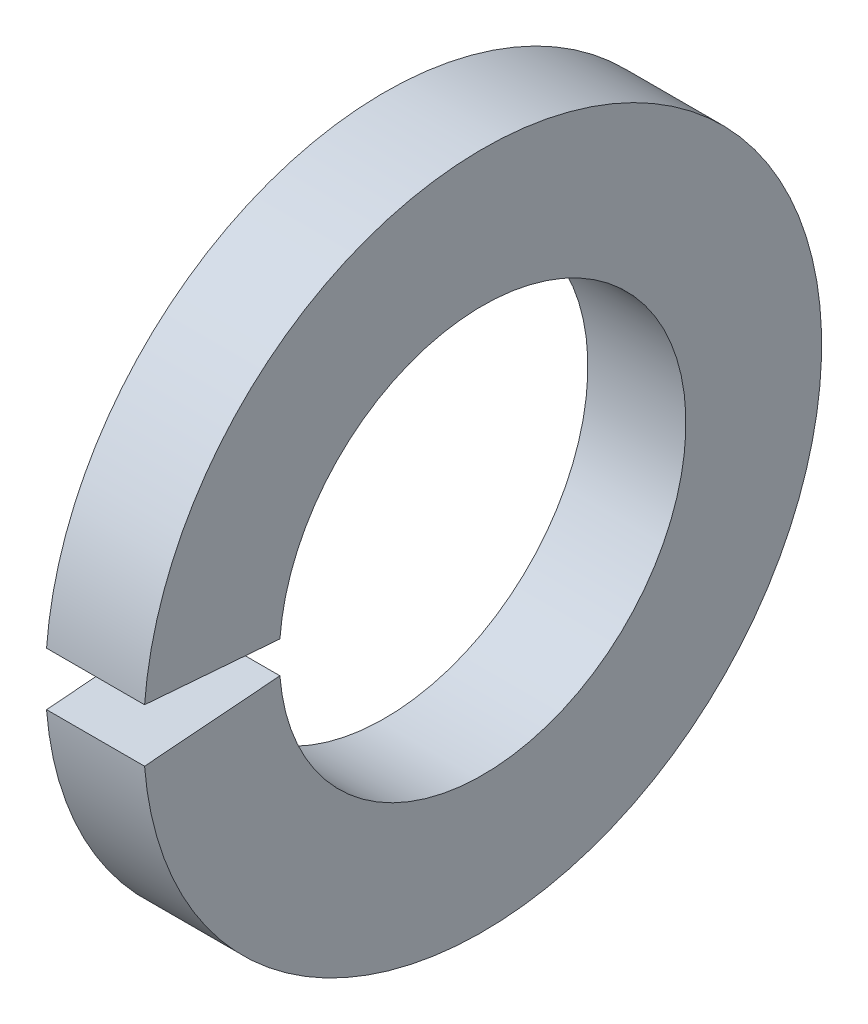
from build123d import *

# Parameters (mm, degrees)
SKETCH1_W = 3.9624
SKETCH1_H = 5.4864
GAP_DEPTH = 20.780330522


with BuildPart() as part:
    # Sketch1 → Base-Revolve (revolve)
    with BuildSketch(Plane.XY, mode=Mode.PRIVATE) as base_revolve_sk:
        with Locations((-1.9812, 10.9601)):
            Rectangle(SKETCH1_W, SKETCH1_H)
    revolve(base_revolve_sk.sketch.rotate(Axis((-34.925, 0, 0), (1, 0, 0)), 90), axis=Axis((-34.925, 0, 0), (1, 0, 0)))

    # Sketch2 → Gap (cut, through all)
    with BuildSketch(Plane(origin=(0, 0, 0), x_dir=(0, -1, 0), z_dir=(-1, 0, 0))):
        with BuildLine():
            Line((0, 0), (1.096651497, 13.934278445))
            ThreePointArc((1.096651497, 13.934278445), (0, 13.977366), (-1.096651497, 13.934278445))
            Line((-1.096651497, 13.934278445), (0, 0))
        make_face()
    extrude(amount=GAP_DEPTH, mode=Mode.SUBTRACT)


solid = part.part
